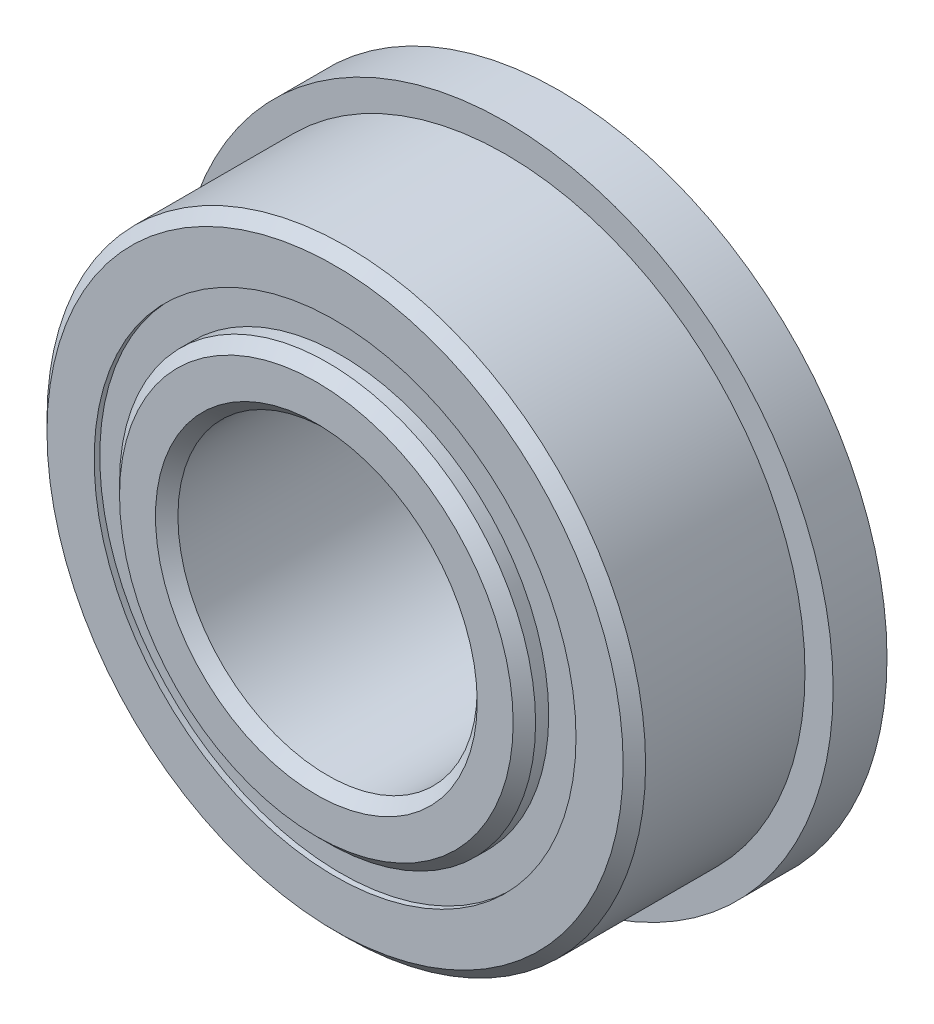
ISO-10303-21;
HEADER;
FILE_DESCRIPTION(('STEP AP214'),'2;1');
FILE_NAME('part.step','',(''),(''),'','','');
FILE_SCHEMA(('AUTOMOTIVE_DESIGN { 1 0 10303 214 1 1 1 1 }'));
ENDSEC;
DATA;
#1=APPLICATION_CONTEXT('core data for automotive mechanical design processes');
#2=APPLICATION_PROTOCOL_DEFINITION('international standard','automotive_design',2000,#1);
#3=PRODUCT_CONTEXT('',#1,'mechanical');
#4=PRODUCT('Part','Part','',(#3));
#5=PRODUCT_RELATED_PRODUCT_CATEGORY('part','',(#4));
#6=PRODUCT_DEFINITION_FORMATION('','',#4);
#7=PRODUCT_DEFINITION_CONTEXT('part definition',#1,'design');
#8=PRODUCT_DEFINITION('design','',#6,#7);
#9=PRODUCT_DEFINITION_SHAPE('','',#8);
#10=(LENGTH_UNIT() NAMED_UNIT(*) SI_UNIT(.MILLI.,.METRE.));
#11=(NAMED_UNIT(*) PLANE_ANGLE_UNIT() SI_UNIT($,.RADIAN.));
#12=(NAMED_UNIT(*) SI_UNIT($,.STERADIAN.) SOLID_ANGLE_UNIT());
#13=UNCERTAINTY_MEASURE_WITH_UNIT(LENGTH_MEASURE(1.E-05),#10,'distance_accuracy_value','');
#14=(GEOMETRIC_REPRESENTATION_CONTEXT(3) GLOBAL_UNCERTAINTY_ASSIGNED_CONTEXT((#13)) GLOBAL_UNIT_ASSIGNED_CONTEXT((#10,
#11,#12)) REPRESENTATION_CONTEXT('',''));
#15=CARTESIAN_POINT('',(0.,0.,0.));
#16=DIRECTION('',(0.,0.,1.));
#17=DIRECTION('',(1.,0.,0.));
#18=AXIS2_PLACEMENT_3D('',#15,#16,#17);
#19=CARTESIAN_POINT('',(0.,5.1114010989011,-2.2621875));
#20=DIRECTION('',(0.,0.,1.));
#21=DIRECTION('',(1.,0.,0.));
#22=AXIS2_PLACEMENT_3D('',#19,#20,#21);
#23=PLANE('',#22);
#24=CARTESIAN_POINT('',(0.,0.,-2.2621875));
#25=DIRECTION('',(0.,0.,1.));
#26=DIRECTION('',(1.,0.,0.));
#27=AXIS2_PLACEMENT_3D('',#24,#25,#26);
#28=CIRCLE('',#27,5.1114010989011);
#29=CARTESIAN_POINT('',(5.1114010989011,0.,-2.2621875));
#30=VERTEX_POINT('',#29);
#31=EDGE_CURVE('E56',#30,#30,#28,.T.);
#32=ORIENTED_EDGE('',*,*,#31,.F.);
#33=EDGE_LOOP('',(#32));
#34=FACE_BOUND('',#33,.T.);
#35=CARTESIAN_POINT('',(0.,0.,-2.2621875));
#36=DIRECTION('',(0.,0.,1.));
#37=DIRECTION('',(1.,0.,0.));
#38=AXIS2_PLACEMENT_3D('',#35,#36,#37);
#39=CIRCLE('',#38,4.4135989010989);
#40=CARTESIAN_POINT('',(4.4135989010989,0.,-2.2621875));
#41=VERTEX_POINT('',#40);
#42=EDGE_CURVE('E11',#41,#41,#39,.T.);
#43=ORIENTED_EDGE('',*,*,#42,.T.);
#44=EDGE_LOOP('',(#43));
#45=FACE_BOUND('',#44,.T.);
#46=ADVANCED_FACE('F42',(#34,#45),#23,.F.);
#47=CARTESIAN_POINT('',(0.,0.,2.38125));
#48=DIRECTION('',(0.,0.,1.));
#49=DIRECTION('',(1.,0.,0.));
#50=AXIS2_PLACEMENT_3D('',#47,#48,#49);
#51=CYLINDRICAL_SURFACE('',#50,4.4135989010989);
#52=ORIENTED_EDGE('',*,*,#42,.F.);
#53=EDGE_LOOP('',(#52));
#54=FACE_BOUND('',#53,.T.);
#55=CARTESIAN_POINT('',(0.,0.,-1.11436144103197));
#56=DIRECTION('',(0.,0.,1.));
#57=DIRECTION('',(1.,0.,0.));
#58=AXIS2_PLACEMENT_3D('',#55,#56,#57);
#59=CIRCLE('',#58,4.4135989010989);
#60=CARTESIAN_POINT('',(4.4135989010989,0.,-1.11436144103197));
#61=VERTEX_POINT('',#60);
#62=EDGE_CURVE('E48',#61,#61,#59,.T.);
#63=ORIENTED_EDGE('',*,*,#62,.T.);
#64=EDGE_LOOP('',(#63));
#65=FACE_BOUND('',#64,.T.);
#66=ADVANCED_FACE('F65',(#54,#65),#51,.F.);
#67=CARTESIAN_POINT('',(0.,5.1114010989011,-1.11436144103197));
#68=DIRECTION('',(0.,0.,-1.));
#69=DIRECTION('',(-1.,0.,0.));
#70=AXIS2_PLACEMENT_3D('',#67,#68,#69);
#71=PLANE('',#70);
#72=ORIENTED_EDGE('',*,*,#62,.F.);
#73=EDGE_LOOP('',(#72));
#74=FACE_BOUND('',#73,.T.);
#75=CARTESIAN_POINT('',(0.,0.,-1.11436144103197));
#76=DIRECTION('',(0.,0.,1.));
#77=DIRECTION('',(1.,0.,0.));
#78=AXIS2_PLACEMENT_3D('',#75,#76,#77);
#79=CIRCLE('',#78,5.1114010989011);
#80=CARTESIAN_POINT('',(5.1114010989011,0.,-1.11436144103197));
#81=VERTEX_POINT('',#80);
#82=EDGE_CURVE('E52',#81,#81,#79,.T.);
#83=ORIENTED_EDGE('',*,*,#82,.T.);
#84=EDGE_LOOP('',(#83));
#85=FACE_BOUND('',#84,.T.);
#86=ADVANCED_FACE('F69',(#74,#85),#71,.F.);
#87=CARTESIAN_POINT('',(0.,0.,2.38125));
#88=DIRECTION('',(0.,0.,1.));
#89=DIRECTION('',(1.,0.,0.));
#90=AXIS2_PLACEMENT_3D('',#87,#88,#89);
#91=CYLINDRICAL_SURFACE('',#90,5.1114010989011);
#92=ORIENTED_EDGE('',*,*,#82,.F.);
#93=EDGE_LOOP('',(#92));
#94=FACE_BOUND('',#93,.T.);
#95=ORIENTED_EDGE('',*,*,#31,.T.);
#96=EDGE_LOOP('',(#95));
#97=FACE_BOUND('',#96,.T.);
#98=ADVANCED_FACE('F62',(#94,#97),#91,.T.);
#99=CLOSED_SHELL('',(#46,#66,#86,#98));
#100=MANIFOLD_SOLID_BREP('B2',#99);
#101=CARTESIAN_POINT('',(0.,5.1114010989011,2.2621875));
#102=DIRECTION('',(0.,0.,-1.));
#103=DIRECTION('',(-1.,0.,0.));
#104=AXIS2_PLACEMENT_3D('',#101,#102,#103);
#105=PLANE('',#104);
#106=CARTESIAN_POINT('',(0.,0.,2.2621875));
#107=DIRECTION('',(0.,0.,1.));
#108=DIRECTION('',(1.,0.,0.));
#109=AXIS2_PLACEMENT_3D('',#106,#107,#108);
#110=CIRCLE('',#109,4.4135989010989);
#111=CARTESIAN_POINT('',(4.4135989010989,0.,2.2621875));
#112=VERTEX_POINT('',#111);
#113=EDGE_CURVE('E41',#112,#112,#110,.T.);
#114=ORIENTED_EDGE('',*,*,#113,.F.);
#115=EDGE_LOOP('',(#114));
#116=FACE_BOUND('',#115,.T.);
#117=CARTESIAN_POINT('',(0.,0.,2.2621875));
#118=DIRECTION('',(0.,0.,1.));
#119=DIRECTION('',(1.,0.,0.));
#120=AXIS2_PLACEMENT_3D('',#117,#118,#119);
#121=CIRCLE('',#120,5.1114010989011);
#122=CARTESIAN_POINT('',(5.1114010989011,0.,2.2621875));
#123=VERTEX_POINT('',#122);
#124=EDGE_CURVE('E124',#123,#123,#121,.T.);
#125=ORIENTED_EDGE('',*,*,#124,.T.);
#126=EDGE_LOOP('',(#125));
#127=FACE_BOUND('',#126,.T.);
#128=ADVANCED_FACE('F110',(#116,#127),#105,.F.);
#129=CARTESIAN_POINT('',(0.,0.,2.38125));
#130=DIRECTION('',(0.,0.,1.));
#131=DIRECTION('',(1.,0.,0.));
#132=AXIS2_PLACEMENT_3D('',#129,#130,#131);
#133=CYLINDRICAL_SURFACE('',#132,4.4135989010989);
#134=CARTESIAN_POINT('',(0.,0.,1.11436144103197));
#135=DIRECTION('',(0.,0.,1.));
#136=DIRECTION('',(1.,0.,0.));
#137=AXIS2_PLACEMENT_3D('',#134,#135,#136);
#138=CIRCLE('',#137,4.4135989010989);
#139=CARTESIAN_POINT('',(4.4135989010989,0.,1.11436144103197));
#140=VERTEX_POINT('',#139);
#141=EDGE_CURVE('E116',#140,#140,#138,.T.);
#142=ORIENTED_EDGE('',*,*,#141,.F.);
#143=EDGE_LOOP('',(#142));
#144=FACE_BOUND('',#143,.T.);
#145=ORIENTED_EDGE('',*,*,#113,.T.);
#146=EDGE_LOOP('',(#145));
#147=FACE_BOUND('',#146,.T.);
#148=ADVANCED_FACE('F139',(#144,#147),#133,.F.);
#149=CARTESIAN_POINT('',(0.,5.1114010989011,1.11436144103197));
#150=DIRECTION('',(0.,0.,1.));
#151=DIRECTION('',(1.,0.,0.));
#152=AXIS2_PLACEMENT_3D('',#149,#150,#151);
#153=PLANE('',#152);
#154=CARTESIAN_POINT('',(0.,0.,1.11436144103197));
#155=DIRECTION('',(0.,0.,1.));
#156=DIRECTION('',(1.,0.,0.));
#157=AXIS2_PLACEMENT_3D('',#154,#155,#156);
#158=CIRCLE('',#157,5.1114010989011);
#159=CARTESIAN_POINT('',(5.1114010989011,0.,1.11436144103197));
#160=VERTEX_POINT('',#159);
#161=EDGE_CURVE('E120',#160,#160,#158,.T.);
#162=ORIENTED_EDGE('',*,*,#161,.F.);
#163=EDGE_LOOP('',(#162));
#164=FACE_BOUND('',#163,.T.);
#165=ORIENTED_EDGE('',*,*,#141,.T.);
#166=EDGE_LOOP('',(#165));
#167=FACE_BOUND('',#166,.T.);
#168=ADVANCED_FACE('F134',(#164,#167),#153,.F.);
#169=CARTESIAN_POINT('',(0.,0.,2.38125));
#170=DIRECTION('',(0.,0.,1.));
#171=DIRECTION('',(1.,0.,0.));
#172=AXIS2_PLACEMENT_3D('',#169,#170,#171);
#173=CYLINDRICAL_SURFACE('',#172,5.1114010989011);
#174=ORIENTED_EDGE('',*,*,#124,.F.);
#175=EDGE_LOOP('',(#174));
#176=FACE_BOUND('',#175,.T.);
#177=ORIENTED_EDGE('',*,*,#161,.T.);
#178=EDGE_LOOP('',(#177));
#179=FACE_BOUND('',#178,.T.);
#180=ADVANCED_FACE('F131',(#176,#179),#173,.T.);
#181=CLOSED_SHELL('',(#128,#148,#168,#180));
#182=MANIFOLD_SOLID_BREP('B6',#181);
#183=CARTESIAN_POINT('',(-2.38124999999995,4.12444598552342,0.));
#184=DIRECTION('',(0.,0.,1.));
#185=DIRECTION('',(-0.499999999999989,0.866025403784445,0.));
#186=AXIS2_PLACEMENT_3D('',#183,#184,#185);
#187=SPHERICAL_SURFACE('',#186,1.11436144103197);
#188=CARTESIAN_POINT('',(-2.38124999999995,4.12444598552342,1.11436144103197));
#189=VERTEX_POINT('',#188);
#190=VERTEX_LOOP('',#189);
#191=FACE_BOUND('',#190,.T.);
#192=ADVANCED_FACE('F177',(#191),#187,.T.);
#193=CLOSED_SHELL('',(#192));
#194=MANIFOLD_SOLID_BREP('B36',#193);
#195=CARTESIAN_POINT('',(-4.12444598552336,2.38125000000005,0.));
#196=DIRECTION('',(0.,0.,1.));
#197=DIRECTION('',(-0.866025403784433,0.50000000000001,0.));
#198=AXIS2_PLACEMENT_3D('',#195,#196,#197);
#199=SPHERICAL_SURFACE('',#198,1.11436144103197);
#200=CARTESIAN_POINT('',(-4.12444598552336,2.38125000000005,1.11436144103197));
#201=VERTEX_POINT('',#200);
#202=VERTEX_LOOP('',#201);
#203=FACE_BOUND('',#202,.T.);
#204=ADVANCED_FACE('F197',(#203),#199,.T.);
#205=CLOSED_SHELL('',(#204));
#206=MANIFOLD_SOLID_BREP('B106',#205);
#207=CARTESIAN_POINT('',(-4.7625,0.,0.));
#208=DIRECTION('',(0.,0.,1.));
#209=DIRECTION('',(-1.,0.,0.));
#210=AXIS2_PLACEMENT_3D('',#207,#208,#209);
#211=SPHERICAL_SURFACE('',#210,1.11436144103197);
#212=CARTESIAN_POINT('',(-4.7625,0.,1.11436144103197));
#213=VERTEX_POINT('',#212);
#214=VERTEX_LOOP('',#213);
#215=FACE_BOUND('',#214,.T.);
#216=ADVANCED_FACE('F217',(#215),#211,.T.);
#217=CLOSED_SHELL('',(#216));
#218=MANIFOLD_SOLID_BREP('B173',#217);
#219=CARTESIAN_POINT('',(-4.12444598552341,-2.38124999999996,0.));
#220=DIRECTION('',(0.,0.,1.));
#221=DIRECTION('',(-0.866025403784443,-0.499999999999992,0.));
#222=AXIS2_PLACEMENT_3D('',#219,#220,#221);
#223=SPHERICAL_SURFACE('',#222,1.11436144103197);
#224=CARTESIAN_POINT('',(-4.12444598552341,-2.38124999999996,1.11436144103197));
#225=VERTEX_POINT('',#224);
#226=VERTEX_LOOP('',#225);
#227=FACE_BOUND('',#226,.T.);
#228=ADVANCED_FACE('F237',(#227),#223,.T.);
#229=CLOSED_SHELL('',(#228));
#230=MANIFOLD_SOLID_BREP('B193',#229);
#231=CARTESIAN_POINT('',(-2.38125000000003,-4.12444598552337,0.));
#232=DIRECTION('',(0.,0.,1.));
#233=DIRECTION('',(-0.500000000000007,-0.866025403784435,0.));
#234=AXIS2_PLACEMENT_3D('',#231,#232,#233);
#235=SPHERICAL_SURFACE('',#234,1.11436144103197);
#236=CARTESIAN_POINT('',(-2.38125000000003,-4.12444598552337,1.11436144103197));
#237=VERTEX_POINT('',#236);
#238=VERTEX_LOOP('',#237);
#239=FACE_BOUND('',#238,.T.);
#240=ADVANCED_FACE('F257',(#239),#235,.T.);
#241=CLOSED_SHELL('',(#240));
#242=MANIFOLD_SOLID_BREP('B213',#241);
#243=CARTESIAN_POINT('',(0.,-4.7625,0.));
#244=DIRECTION('',(0.,0.,1.));
#245=DIRECTION('',(0.,-1.,0.));
#246=AXIS2_PLACEMENT_3D('',#243,#244,#245);
#247=SPHERICAL_SURFACE('',#246,1.11436144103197);
#248=CARTESIAN_POINT('',(0.,-4.7625,1.11436144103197));
#249=VERTEX_POINT('',#248);
#250=VERTEX_LOOP('',#249);
#251=FACE_BOUND('',#250,.T.);
#252=ADVANCED_FACE('F277',(#251),#247,.T.);
#253=CLOSED_SHELL('',(#252));
#254=MANIFOLD_SOLID_BREP('B233',#253);
#255=CARTESIAN_POINT('',(2.38124999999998,-4.1244459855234,0.));
#256=DIRECTION('',(0.,0.,1.));
#257=DIRECTION('',(0.499999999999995,-0.866025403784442,0.));
#258=AXIS2_PLACEMENT_3D('',#255,#256,#257);
#259=SPHERICAL_SURFACE('',#258,1.11436144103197);
#260=CARTESIAN_POINT('',(2.38124999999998,-4.1244459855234,1.11436144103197));
#261=VERTEX_POINT('',#260);
#262=VERTEX_LOOP('',#261);
#263=FACE_BOUND('',#262,.T.);
#264=ADVANCED_FACE('F297',(#263),#259,.T.);
#265=CLOSED_SHELL('',(#264));
#266=MANIFOLD_SOLID_BREP('B253',#265);
#267=CARTESIAN_POINT('',(4.12444598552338,-2.38125000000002,0.));
#268=DIRECTION('',(0.,0.,1.));
#269=DIRECTION('',(0.866025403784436,-0.500000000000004,0.));
#270=AXIS2_PLACEMENT_3D('',#267,#268,#269);
#271=SPHERICAL_SURFACE('',#270,1.11436144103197);
#272=CARTESIAN_POINT('',(4.12444598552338,-2.38125000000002,1.11436144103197));
#273=VERTEX_POINT('',#272);
#274=VERTEX_LOOP('',#273);
#275=FACE_BOUND('',#274,.T.);
#276=ADVANCED_FACE('F317',(#275),#271,.T.);
#277=CLOSED_SHELL('',(#276));
#278=MANIFOLD_SOLID_BREP('B273',#277);
#279=CARTESIAN_POINT('',(4.7625,0.,0.));
#280=DIRECTION('',(0.,0.,1.));
#281=DIRECTION('',(1.,0.,0.));
#282=AXIS2_PLACEMENT_3D('',#279,#280,#281);
#283=SPHERICAL_SURFACE('',#282,1.11436144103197);
#284=CARTESIAN_POINT('',(4.7625,0.,1.11436144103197));
#285=VERTEX_POINT('',#284);
#286=VERTEX_LOOP('',#285);
#287=FACE_BOUND('',#286,.T.);
#288=ADVANCED_FACE('F337',(#287),#283,.T.);
#289=CLOSED_SHELL('',(#288));
#290=MANIFOLD_SOLID_BREP('B293',#289);
#291=CARTESIAN_POINT('',(4.12444598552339,2.38124999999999,0.));
#292=DIRECTION('',(0.,0.,1.));
#293=DIRECTION('',(0.86602540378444,0.499999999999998,0.));
#294=AXIS2_PLACEMENT_3D('',#291,#292,#293);
#295=SPHERICAL_SURFACE('',#294,1.11436144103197);
#296=CARTESIAN_POINT('',(4.12444598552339,2.38124999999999,1.11436144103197));
#297=VERTEX_POINT('',#296);
#298=VERTEX_LOOP('',#297);
#299=FACE_BOUND('',#298,.T.);
#300=ADVANCED_FACE('F357',(#299),#295,.T.);
#301=CLOSED_SHELL('',(#300));
#302=MANIFOLD_SOLID_BREP('B313',#301);
#303=CARTESIAN_POINT('',(2.38125,4.12444598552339,0.));
#304=DIRECTION('',(0.,0.,1.));
#305=DIRECTION('',(0.500000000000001,0.866025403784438,0.));
#306=AXIS2_PLACEMENT_3D('',#303,#304,#305);
#307=SPHERICAL_SURFACE('',#306,1.11436144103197);
#308=CARTESIAN_POINT('',(2.38125,4.12444598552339,1.11436144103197));
#309=VERTEX_POINT('',#308);
#310=VERTEX_LOOP('',#309);
#311=FACE_BOUND('',#310,.T.);
#312=ADVANCED_FACE('F377',(#311),#307,.T.);
#313=CLOSED_SHELL('',(#312));
#314=MANIFOLD_SOLID_BREP('B333',#313);
#315=CARTESIAN_POINT('',(0.,4.7625,0.));
#316=DIRECTION('',(0.,0.,1.));
#317=DIRECTION('',(0.,1.,0.));
#318=AXIS2_PLACEMENT_3D('',#315,#316,#317);
#319=SPHERICAL_SURFACE('',#318,1.11436144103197);
#320=CARTESIAN_POINT('',(0.,4.7625,1.11436144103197));
#321=VERTEX_POINT('',#320);
#322=VERTEX_LOOP('',#321);
#323=FACE_BOUND('',#322,.T.);
#324=ADVANCED_FACE('F400',(#323),#319,.T.);
#325=CLOSED_SHELL('',(#324));
#326=MANIFOLD_SOLID_BREP('B353',#325);
#327=CARTESIAN_POINT('',(0.,0.,2.540635));
#328=DIRECTION('',(0.,0.,-1.));
#329=DIRECTION('',(-1.,0.,0.));
#330=AXIS2_PLACEMENT_3D('',#327,#328,#329);
#331=CONICAL_SURFACE('',#330,4.4135989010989,0.785398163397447);
#332=CARTESIAN_POINT('',(0.,0.,2.77876));
#333=DIRECTION('',(0.,0.,1.));
#334=DIRECTION('',(1.,0.,0.));
#335=AXIS2_PLACEMENT_3D('',#332,#333,#334);
#336=CIRCLE('',#335,4.1754739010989);
#337=CARTESIAN_POINT('',(4.1754739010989,0.,2.77876));
#338=VERTEX_POINT('',#337);
#339=EDGE_CURVE('E454',#338,#338,#336,.T.);
#340=ORIENTED_EDGE('',*,*,#339,.F.);
#341=EDGE_LOOP('',(#340));
#342=FACE_BOUND('',#341,.T.);
#343=CARTESIAN_POINT('',(0.,0.,2.540635));
#344=DIRECTION('',(0.,0.,1.));
#345=DIRECTION('',(1.,0.,0.));
#346=AXIS2_PLACEMENT_3D('',#343,#344,#345);
#347=CIRCLE('',#346,4.4135989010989);
#348=CARTESIAN_POINT('',(4.4135989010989,0.,2.540635));
#349=VERTEX_POINT('',#348);
#350=EDGE_CURVE('E399',#349,#349,#347,.T.);
#351=ORIENTED_EDGE('',*,*,#350,.T.);
#352=EDGE_LOOP('',(#351));
#353=FACE_BOUND('',#352,.T.);
#354=ADVANCED_FACE('F420',(#342,#353),#331,.T.);
#355=CARTESIAN_POINT('',(0.,0.,2.38125));
#356=DIRECTION('',(0.,0.,1.));
#357=DIRECTION('',(1.,0.,0.));
#358=AXIS2_PLACEMENT_3D('',#355,#356,#357);
#359=CYLINDRICAL_SURFACE('',#358,4.4135989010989);
#360=ORIENTED_EDGE('',*,*,#350,.F.);
#361=EDGE_LOOP('',(#360));
#362=FACE_BOUND('',#361,.T.);
#363=CARTESIAN_POINT('',(0.,0.,1.05833333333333));
#364=DIRECTION('',(0.,0.,1.));
#365=DIRECTION('',(1.,0.,0.));
#366=AXIS2_PLACEMENT_3D('',#363,#364,#365);
#367=CIRCLE('',#366,4.4135989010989);
#368=CARTESIAN_POINT('',(4.4135989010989,0.,1.05833333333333));
#369=VERTEX_POINT('',#368);
#370=EDGE_CURVE('E426',#369,#369,#367,.T.);
#371=ORIENTED_EDGE('',*,*,#370,.T.);
#372=EDGE_LOOP('',(#371));
#373=FACE_BOUND('',#372,.T.);
#374=ADVANCED_FACE('F461',(#362,#373),#359,.T.);
#375=CARTESIAN_POINT('',(0.,0.,0.));
#376=DIRECTION('',(0.,0.,1.));
#377=DIRECTION('',(1.,0.,0.));
#378=AXIS2_PLACEMENT_3D('',#375,#376,#377);
#379=TOROIDAL_SURFACE('',#378,4.76249999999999,1.11436144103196);
#380=ORIENTED_EDGE('',*,*,#370,.F.);
#381=EDGE_LOOP('',(#380));
#382=FACE_BOUND('',#381,.T.);
#383=CARTESIAN_POINT('',(0.,0.,-1.05833333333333));
#384=DIRECTION('',(0.,0.,1.));
#385=DIRECTION('',(1.,0.,0.));
#386=AXIS2_PLACEMENT_3D('',#383,#384,#385);
#387=CIRCLE('',#386,4.4135989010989);
#388=CARTESIAN_POINT('',(4.4135989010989,0.,-1.05833333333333));
#389=VERTEX_POINT('',#388);
#390=EDGE_CURVE('E430',#389,#389,#387,.T.);
#391=ORIENTED_EDGE('',*,*,#390,.T.);
#392=EDGE_LOOP('',(#391));
#393=FACE_BOUND('',#392,.T.);
#394=ADVANCED_FACE('F465',(#382,#393),#379,.F.);
#395=CARTESIAN_POINT('',(0.,0.,2.38125));
#396=DIRECTION('',(0.,0.,1.));
#397=DIRECTION('',(1.,0.,0.));
#398=AXIS2_PLACEMENT_3D('',#395,#396,#397);
#399=CYLINDRICAL_SURFACE('',#398,4.4135989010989);
#400=ORIENTED_EDGE('',*,*,#390,.F.);
#401=EDGE_LOOP('',(#400));
#402=FACE_BOUND('',#401,.T.);
#403=CARTESIAN_POINT('',(0.,0.,-2.540635));
#404=DIRECTION('',(0.,0.,1.));
#405=DIRECTION('',(1.,0.,0.));
#406=AXIS2_PLACEMENT_3D('',#403,#404,#405);
#407=CIRCLE('',#406,4.4135989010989);
#408=CARTESIAN_POINT('',(4.4135989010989,0.,-2.540635));
#409=VERTEX_POINT('',#408);
#410=EDGE_CURVE('E434',#409,#409,#407,.T.);
#411=ORIENTED_EDGE('',*,*,#410,.T.);
#412=EDGE_LOOP('',(#411));
#413=FACE_BOUND('',#412,.T.);
#414=ADVANCED_FACE('F470',(#402,#413),#399,.T.);
#415=CARTESIAN_POINT('',(0.,0.,-2.77876));
#416=DIRECTION('',(0.,0.,1.));
#417=DIRECTION('',(1.,0.,0.));
#418=AXIS2_PLACEMENT_3D('',#415,#416,#417);
#419=CONICAL_SURFACE('',#418,4.1754739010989,0.785398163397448);
#420=ORIENTED_EDGE('',*,*,#410,.F.);
#421=EDGE_LOOP('',(#420));
#422=FACE_BOUND('',#421,.T.);
#423=CARTESIAN_POINT('',(0.,0.,-2.77876));
#424=DIRECTION('',(0.,0.,1.));
#425=DIRECTION('',(1.,0.,0.));
#426=AXIS2_PLACEMENT_3D('',#423,#424,#425);
#427=CIRCLE('',#426,4.1754739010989);
#428=CARTESIAN_POINT('',(4.1754739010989,0.,-2.77876));
#429=VERTEX_POINT('',#428);
#430=EDGE_CURVE('E439',#429,#429,#427,.T.);
#431=ORIENTED_EDGE('',*,*,#430,.T.);
#432=EDGE_LOOP('',(#431));
#433=FACE_BOUND('',#432,.T.);
#434=ADVANCED_FACE('F476',(#422,#433),#419,.T.);
#435=CARTESIAN_POINT('',(0.,4.1754739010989,-2.77876));
#436=DIRECTION('',(0.,0.,1.));
#437=DIRECTION('',(1.,0.,0.));
#438=AXIS2_PLACEMENT_3D('',#435,#436,#437);
#439=PLANE('',#438);
#440=ORIENTED_EDGE('',*,*,#430,.F.);
#441=EDGE_LOOP('',(#440));
#442=FACE_BOUND('',#441,.T.);
#443=CARTESIAN_POINT('',(0.,0.,-2.77876));
#444=DIRECTION('',(0.,0.,1.));
#445=DIRECTION('',(1.,0.,0.));
#446=AXIS2_PLACEMENT_3D('',#443,#444,#445);
#447=CIRCLE('',#446,3.413125);
#448=CARTESIAN_POINT('',(3.413125,0.,-2.77876));
#449=VERTEX_POINT('',#448);
#450=EDGE_CURVE('E442',#449,#449,#447,.T.);
#451=ORIENTED_EDGE('',*,*,#450,.T.);
#452=EDGE_LOOP('',(#451));
#453=FACE_BOUND('',#452,.T.);
#454=ADVANCED_FACE('F480',(#442,#453),#439,.F.);
#455=CARTESIAN_POINT('',(0.,0.,-2.540635));
#456=DIRECTION('',(0.,0.,-1.));
#457=DIRECTION('',(-1.,0.,0.));
#458=AXIS2_PLACEMENT_3D('',#455,#456,#457);
#459=CONICAL_SURFACE('',#458,3.175,0.78539816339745);
#460=ORIENTED_EDGE('',*,*,#450,.F.);
#461=EDGE_LOOP('',(#460));
#462=FACE_BOUND('',#461,.T.);
#463=CARTESIAN_POINT('',(0.,0.,-2.540635));
#464=DIRECTION('',(0.,0.,1.));
#465=DIRECTION('',(1.,0.,0.));
#466=AXIS2_PLACEMENT_3D('',#463,#464,#465);
#467=CIRCLE('',#466,3.175);
#468=CARTESIAN_POINT('',(3.175,0.,-2.540635));
#469=VERTEX_POINT('',#468);
#470=EDGE_CURVE('E445',#469,#469,#467,.T.);
#471=ORIENTED_EDGE('',*,*,#470,.T.);
#472=EDGE_LOOP('',(#471));
#473=FACE_BOUND('',#472,.T.);
#474=ADVANCED_FACE('F484',(#462,#473),#459,.F.);
#475=CARTESIAN_POINT('',(0.,0.,2.38125));
#476=DIRECTION('',(0.,0.,1.));
#477=DIRECTION('',(1.,0.,0.));
#478=AXIS2_PLACEMENT_3D('',#475,#476,#477);
#479=CYLINDRICAL_SURFACE('',#478,3.175);
#480=ORIENTED_EDGE('',*,*,#470,.F.);
#481=EDGE_LOOP('',(#480));
#482=FACE_BOUND('',#481,.T.);
#483=CARTESIAN_POINT('',(0.,0.,2.540635));
#484=DIRECTION('',(0.,0.,1.));
#485=DIRECTION('',(1.,0.,0.));
#486=AXIS2_PLACEMENT_3D('',#483,#484,#485);
#487=CIRCLE('',#486,3.175);
#488=CARTESIAN_POINT('',(3.175,0.,2.540635));
#489=VERTEX_POINT('',#488);
#490=EDGE_CURVE('E448',#489,#489,#487,.T.);
#491=ORIENTED_EDGE('',*,*,#490,.T.);
#492=EDGE_LOOP('',(#491));
#493=FACE_BOUND('',#492,.T.);
#494=ADVANCED_FACE('F488',(#482,#493),#479,.F.);
#495=CARTESIAN_POINT('',(0.,0.,2.77876));
#496=DIRECTION('',(0.,0.,1.));
#497=DIRECTION('',(1.,0.,0.));
#498=AXIS2_PLACEMENT_3D('',#495,#496,#497);
#499=CONICAL_SURFACE('',#498,3.413125,0.78539816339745);
#500=ORIENTED_EDGE('',*,*,#490,.F.);
#501=EDGE_LOOP('',(#500));
#502=FACE_BOUND('',#501,.T.);
#503=CARTESIAN_POINT('',(0.,0.,2.77876));
#504=DIRECTION('',(0.,0.,1.));
#505=DIRECTION('',(1.,0.,0.));
#506=AXIS2_PLACEMENT_3D('',#503,#504,#505);
#507=CIRCLE('',#506,3.413125);
#508=CARTESIAN_POINT('',(3.413125,0.,2.77876));
#509=VERTEX_POINT('',#508);
#510=EDGE_CURVE('E451',#509,#509,#507,.T.);
#511=ORIENTED_EDGE('',*,*,#510,.T.);
#512=EDGE_LOOP('',(#511));
#513=FACE_BOUND('',#512,.T.);
#514=ADVANCED_FACE('F492',(#502,#513),#499,.F.);
#515=CARTESIAN_POINT('',(0.,3.413125,2.77876));
#516=DIRECTION('',(0.,0.,-1.));
#517=DIRECTION('',(-1.,0.,0.));
#518=AXIS2_PLACEMENT_3D('',#515,#516,#517);
#519=PLANE('',#518);
#520=ORIENTED_EDGE('',*,*,#510,.F.);
#521=EDGE_LOOP('',(#520));
#522=FACE_BOUND('',#521,.T.);
#523=ORIENTED_EDGE('',*,*,#339,.T.);
#524=EDGE_LOOP('',(#523));
#525=FACE_BOUND('',#524,.T.);
#526=ADVANCED_FACE('F458',(#522,#525),#519,.F.);
#527=CLOSED_SHELL('',(#354,#374,#394,#414,#434,#454,#474,#494,#514,#526));
#528=MANIFOLD_SOLID_BREP('B373',#527);
#529=CARTESIAN_POINT('',(0.,0.,2.143125));
#530=DIRECTION('',(0.,0.,-1.));
#531=DIRECTION('',(-1.,0.,0.));
#532=AXIS2_PLACEMENT_3D('',#529,#530,#531);
#533=CONICAL_SURFACE('',#532,6.35,0.785398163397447);
#534=CARTESIAN_POINT('',(0.,0.,2.38125));
#535=DIRECTION('',(0.,0.,1.));
#536=DIRECTION('',(1.,0.,0.));
#537=AXIS2_PLACEMENT_3D('',#534,#535,#536);
#538=CIRCLE('',#537,6.111875);
#539=CARTESIAN_POINT('',(6.111875,0.,2.38125));
#540=VERTEX_POINT('',#539);
#541=EDGE_CURVE('E594',#540,#540,#538,.T.);
#542=ORIENTED_EDGE('',*,*,#541,.F.);
#543=EDGE_LOOP('',(#542));
#544=FACE_BOUND('',#543,.T.);
#545=CARTESIAN_POINT('',(0.,0.,2.143125));
#546=DIRECTION('',(0.,0.,1.));
#547=DIRECTION('',(1.,0.,0.));
#548=AXIS2_PLACEMENT_3D('',#545,#546,#547);
#549=CIRCLE('',#548,6.35);
#550=CARTESIAN_POINT('',(6.35,0.,2.143125));
#551=VERTEX_POINT('',#550);
#552=EDGE_CURVE('E419',#551,#551,#549,.T.);
#553=ORIENTED_EDGE('',*,*,#552,.T.);
#554=EDGE_LOOP('',(#553));
#555=FACE_BOUND('',#554,.T.);
#556=ADVANCED_FACE('F572',(#544,#555),#533,.T.);
#557=CARTESIAN_POINT('',(0.,0.,2.38125));
#558=DIRECTION('',(0.,0.,1.));
#559=DIRECTION('',(1.,0.,0.));
#560=AXIS2_PLACEMENT_3D('',#557,#558,#559);
#561=CYLINDRICAL_SURFACE('',#560,6.35);
#562=CARTESIAN_POINT('',(0.,0.,-1.23825));
#563=DIRECTION('',(0.,0.,1.));
#564=DIRECTION('',(1.,0.,0.));
#565=AXIS2_PLACEMENT_3D('',#562,#563,#564);
#566=CIRCLE('',#565,6.35);
#567=CARTESIAN_POINT('',(6.35,0.,-1.23825));
#568=VERTEX_POINT('',#567);
#569=EDGE_CURVE('E597',#568,#568,#566,.T.);
#570=ORIENTED_EDGE('',*,*,#569,.T.);
#571=EDGE_LOOP('',(#570));
#572=FACE_BOUND('',#571,.T.);
#573=ORIENTED_EDGE('',*,*,#552,.F.);
#574=EDGE_LOOP('',(#573));
#575=FACE_BOUND('',#574,.T.);
#576=ADVANCED_FACE('F617',(#572,#575),#561,.T.);
#577=CARTESIAN_POINT('',(0.,6.111875,-2.38125));
#578=DIRECTION('',(0.,0.,1.));
#579=DIRECTION('',(1.,0.,0.));
#580=AXIS2_PLACEMENT_3D('',#577,#578,#579);
#581=PLANE('',#580);
#582=CARTESIAN_POINT('',(0.,0.,-2.38125));
#583=DIRECTION('',(0.,0.,1.));
#584=DIRECTION('',(1.,0.,0.));
#585=AXIS2_PLACEMENT_3D('',#582,#583,#584);
#586=CIRCLE('',#585,5.1114010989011);
#587=CARTESIAN_POINT('',(5.1114010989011,0.,-2.38125));
#588=VERTEX_POINT('',#587);
#589=EDGE_CURVE('E578',#588,#588,#586,.T.);
#590=ORIENTED_EDGE('',*,*,#589,.T.);
#591=EDGE_LOOP('',(#590));
#592=FACE_BOUND('',#591,.T.);
#593=CARTESIAN_POINT('',(0.,0.,-2.38125));
#594=DIRECTION('',(0.,0.,-1.));
#595=DIRECTION('',(-1.,0.,0.));
#596=AXIS2_PLACEMENT_3D('',#593,#594,#595);
#597=CIRCLE('',#596,6.9469);
#598=CARTESIAN_POINT('',(-6.9469,0.,-2.38125));
#599=VERTEX_POINT('',#598);
#600=EDGE_CURVE('E600',#599,#599,#597,.T.);
#601=ORIENTED_EDGE('',*,*,#600,.T.);
#602=EDGE_LOOP('',(#601));
#603=FACE_BOUND('',#602,.T.);
#604=ADVANCED_FACE('F620',(#592,#603),#581,.F.);
#605=CARTESIAN_POINT('',(0.,0.,2.38125));
#606=DIRECTION('',(0.,0.,1.));
#607=DIRECTION('',(1.,0.,0.));
#608=AXIS2_PLACEMENT_3D('',#605,#606,#607);
#609=CYLINDRICAL_SURFACE('',#608,5.1114010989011);
#610=CARTESIAN_POINT('',(0.,0.,-1.05833333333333));
#611=DIRECTION('',(0.,0.,1.));
#612=DIRECTION('',(1.,0.,0.));
#613=AXIS2_PLACEMENT_3D('',#610,#611,#612);
#614=CIRCLE('',#613,5.1114010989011);
#615=CARTESIAN_POINT('',(5.1114010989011,0.,-1.05833333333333));
#616=VERTEX_POINT('',#615);
#617=EDGE_CURVE('E582',#616,#616,#614,.T.);
#618=ORIENTED_EDGE('',*,*,#617,.T.);
#619=EDGE_LOOP('',(#618));
#620=FACE_BOUND('',#619,.T.);
#621=ORIENTED_EDGE('',*,*,#589,.F.);
#622=EDGE_LOOP('',(#621));
#623=FACE_BOUND('',#622,.T.);
#624=ADVANCED_FACE('F625',(#620,#623),#609,.F.);
#625=CARTESIAN_POINT('',(0.,0.,0.));
#626=DIRECTION('',(0.,0.,1.));
#627=DIRECTION('',(1.,0.,0.));
#628=AXIS2_PLACEMENT_3D('',#625,#626,#627);
#629=TOROIDAL_SURFACE('',#628,4.7625,1.11436144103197);
#630=ORIENTED_EDGE('',*,*,#617,.F.);
#631=EDGE_LOOP('',(#630));
#632=FACE_BOUND('',#631,.T.);
#633=CARTESIAN_POINT('',(0.,0.,1.05833333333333));
#634=DIRECTION('',(0.,0.,1.));
#635=DIRECTION('',(1.,0.,0.));
#636=AXIS2_PLACEMENT_3D('',#633,#634,#635);
#637=CIRCLE('',#636,5.1114010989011);
#638=CARTESIAN_POINT('',(5.1114010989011,0.,1.05833333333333));
#639=VERTEX_POINT('',#638);
#640=EDGE_CURVE('E586',#639,#639,#637,.T.);
#641=ORIENTED_EDGE('',*,*,#640,.T.);
#642=EDGE_LOOP('',(#641));
#643=FACE_BOUND('',#642,.T.);
#644=ADVANCED_FACE('F631',(#632,#643),#629,.F.);
#645=CARTESIAN_POINT('',(0.,0.,2.38125));
#646=DIRECTION('',(0.,0.,1.));
#647=DIRECTION('',(1.,0.,0.));
#648=AXIS2_PLACEMENT_3D('',#645,#646,#647);
#649=CYLINDRICAL_SURFACE('',#648,5.1114010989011);
#650=ORIENTED_EDGE('',*,*,#640,.F.);
#651=EDGE_LOOP('',(#650));
#652=FACE_BOUND('',#651,.T.);
#653=CARTESIAN_POINT('',(0.,0.,2.38125));
#654=DIRECTION('',(0.,0.,1.));
#655=DIRECTION('',(1.,0.,0.));
#656=AXIS2_PLACEMENT_3D('',#653,#654,#655);
#657=CIRCLE('',#656,5.1114010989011);
#658=CARTESIAN_POINT('',(5.1114010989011,0.,2.38125));
#659=VERTEX_POINT('',#658);
#660=EDGE_CURVE('E591',#659,#659,#657,.T.);
#661=ORIENTED_EDGE('',*,*,#660,.T.);
#662=EDGE_LOOP('',(#661));
#663=FACE_BOUND('',#662,.T.);
#664=ADVANCED_FACE('F635',(#652,#663),#649,.F.);
#665=CARTESIAN_POINT('',(0.,6.111875,2.38125));
#666=DIRECTION('',(0.,0.,-1.));
#667=DIRECTION('',(-1.,0.,0.));
#668=AXIS2_PLACEMENT_3D('',#665,#666,#667);
#669=PLANE('',#668);
#670=ORIENTED_EDGE('',*,*,#660,.F.);
#671=EDGE_LOOP('',(#670));
#672=FACE_BOUND('',#671,.T.);
#673=ORIENTED_EDGE('',*,*,#541,.T.);
#674=EDGE_LOOP('',(#673));
#675=FACE_BOUND('',#674,.T.);
#676=ADVANCED_FACE('F613',(#672,#675),#669,.F.);
#677=CARTESIAN_POINT('',(0.,5.1114010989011,-1.23825));
#678=DIRECTION('',(0.,0.,1.));
#679=DIRECTION('',(1.,0.,0.));
#680=AXIS2_PLACEMENT_3D('',#677,#678,#679);
#681=PLANE('',#680);
#682=CARTESIAN_POINT('',(0.,0.,-1.23825));
#683=DIRECTION('',(0.,0.,-1.));
#684=DIRECTION('',(-1.,0.,0.));
#685=AXIS2_PLACEMENT_3D('',#682,#683,#684);
#686=CIRCLE('',#685,6.9469);
#687=CARTESIAN_POINT('',(-6.9469,0.,-1.23825));
#688=VERTEX_POINT('',#687);
#689=EDGE_CURVE('E603',#688,#688,#686,.T.);
#690=ORIENTED_EDGE('',*,*,#689,.F.);
#691=EDGE_LOOP('',(#690));
#692=FACE_BOUND('',#691,.T.);
#693=ORIENTED_EDGE('',*,*,#569,.F.);
#694=EDGE_LOOP('',(#693));
#695=FACE_BOUND('',#694,.T.);
#696=ADVANCED_FACE('F610',(#692,#695),#681,.T.);
#697=CARTESIAN_POINT('',(0.,0.,-2.38125));
#698=DIRECTION('',(0.,0.,-1.));
#699=DIRECTION('',(-1.,0.,0.));
#700=AXIS2_PLACEMENT_3D('',#697,#698,#699);
#701=CYLINDRICAL_SURFACE('',#700,6.9469);
#702=ORIENTED_EDGE('',*,*,#689,.T.);
#703=EDGE_LOOP('',(#702));
#704=FACE_BOUND('',#703,.T.);
#705=ORIENTED_EDGE('',*,*,#600,.F.);
#706=EDGE_LOOP('',(#705));
#707=FACE_BOUND('',#706,.T.);
#708=ADVANCED_FACE('F607',(#704,#707),#701,.T.);
#709=CLOSED_SHELL('',(#556,#576,#604,#624,#644,#664,#676,#696,#708));
#710=MANIFOLD_SOLID_BREP('B394',#709);
#711=ADVANCED_BREP_SHAPE_REPRESENTATION('',(#18,#100,#182,#194,#206,#218,#230,#242,#254,#266,
#278,#290,#302,#314,#326,#528,#710),#14);
#712=SHAPE_DEFINITION_REPRESENTATION(#9,#711);
ENDSEC;
END-ISO-10303-21;
